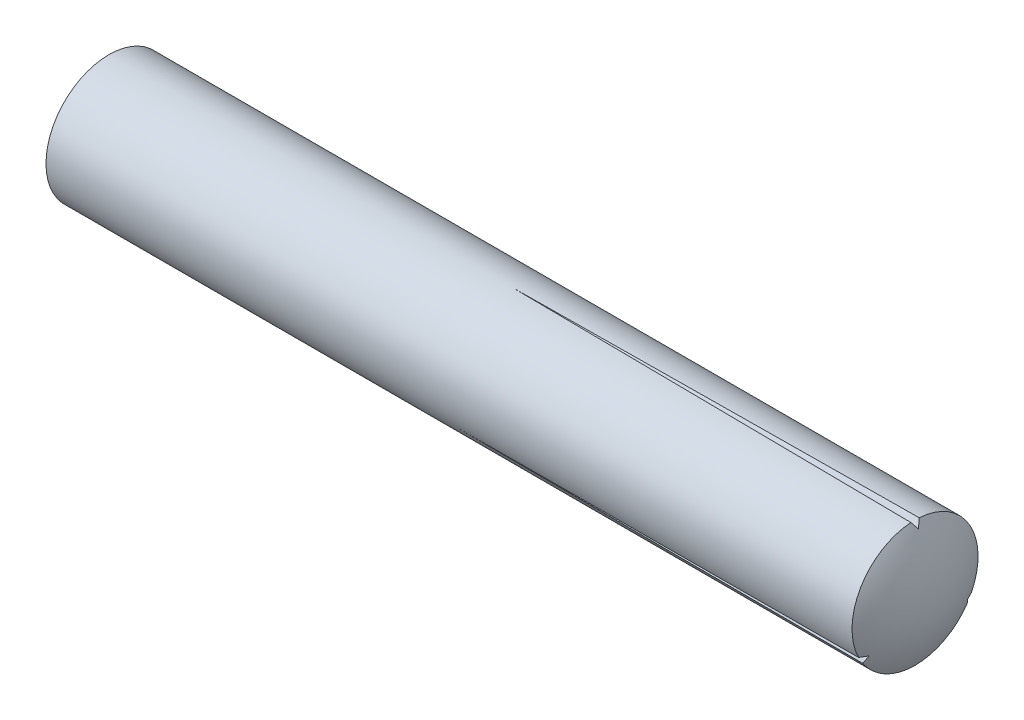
from build123d import *

# Parameters (mm, degrees)
CIRPATTERN2_COUNT = 3


with BuildPart() as part:
    # Sketch1 → Base-Revolve (revolve)
    with BuildSketch(Plane.XY):
        with BuildLine():
            Line((10, 0), (0, 0))
            ThreePointArc((0, 0), (0.051111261, 0.388228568), (0.200961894, 0.75))
            Line((0.200961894, 0.75), (9.799038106, 0.75))
            ThreePointArc((9.799038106, 0.75), (9.948888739, 0.388228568), (10, 0))
        make_face()
    revolve(axis=Axis((-11.749551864, 0, 0), (1, 0, 0)))

    # Sketch4 → Cut-Loft2 section 0
    with BuildSketch(Plane(origin=(10, 0, 0), x_dir=(0, 0, -1), z_dir=(1, 0, 0)), mode=Mode.PRIVATE) as cut_loft2_s0:
        with BuildLine():
            Line((-0.052515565, 0.75), (0, 0.675))
            Line((0, 0.675), (0.052515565, 0.75))
            Line((0.052515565, 0.75), (-0.052515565, 0.75))
        make_face()
    cut_loft2 = loft([Vertex(5, 0.75, 0), cut_loft2_s0.sketch], mode=Mode.SUBTRACT)

    # CirPattern2: Cut-Loft2 ×3 about axis
    cirpattern2_axis = Axis((0, 0, 0), (1, 0, 0))
    for i in range(1, CIRPATTERN2_COUNT):
        add(cut_loft2.rotate(cirpattern2_axis, i * 360 / CIRPATTERN2_COUNT), mode=Mode.SUBTRACT)


solid = part.part
